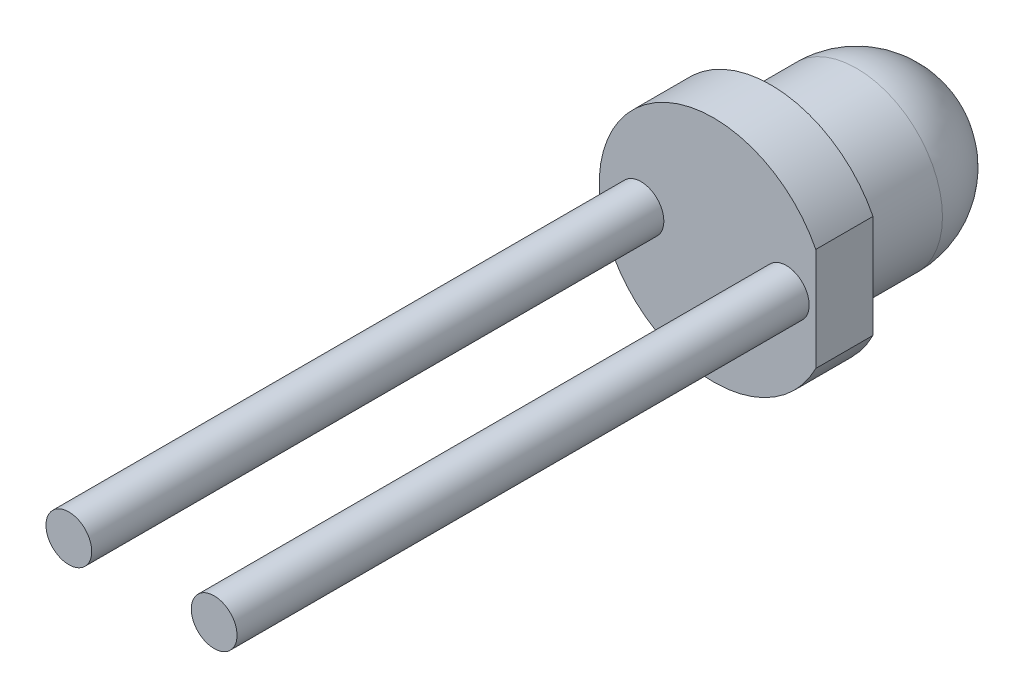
from build123d import *

# Parameters (mm, degrees)
ESQUISSE1_R          = 1.5
BASE_EXTRUSION_DEPTH = 4
BOSS_EXTRU_1_DEPTH   = 1
CONG_1_R             = 1.5
ESQUISSE3_R          = 0.4
EXTRUSION1_DEPTH     = 10


with BuildPart() as part:
    # Esquisse1 → Base-Extrusion (new body)
    with BuildSketch(Plane.XY):
        Circle(ESQUISSE1_R)
    extrude(amount=BASE_EXTRUSION_DEPTH)

    # Esquisse2 → Boss.-Extru.1 (add)
    with BuildSketch(Plane.XY.offset(4)):
        with BuildLine():
            Line((1.785714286, 0.900680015), (1.785714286, -0.900680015))
            ThreePointArc((1.785714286, -0.900680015), (-2, 0), (1.785714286, 0.900680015))
        make_face()
    extrude(amount=-BOSS_EXTRU_1_DEPTH)

    # Cong_1
    cong_1_edges = [part.edges().sort_by_distance(p)[0] for p in [
        (-1.5, 0, 0),
    ]]
    fillet(cong_1_edges, radius=CONG_1_R)

    # Esquisse3 → Extrusion1 (add)
    with BuildSketch(Plane.XY.offset(4)):
        with Locations((1.27, 0)):
            Circle(ESQUISSE3_R)
        with Locations((-1.27, 0)):
            Circle(ESQUISSE3_R)
    extrude(amount=EXTRUSION1_DEPTH)


solid = part.part
